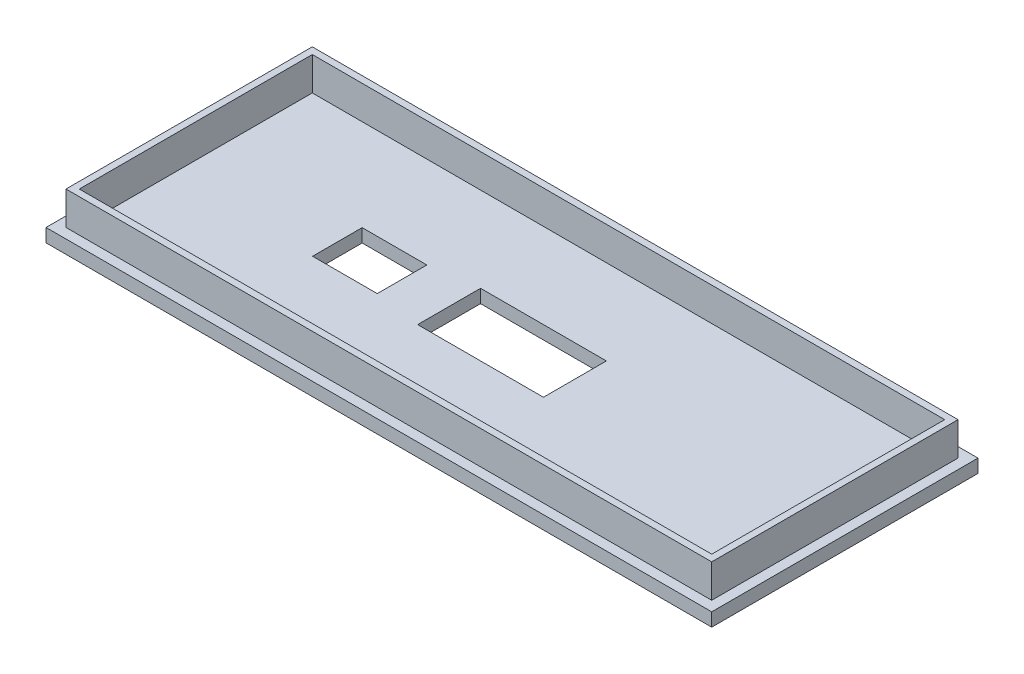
ISO-10303-21;
HEADER;
FILE_DESCRIPTION(('STEP AP214'),'2;1');
FILE_NAME('part.step','',(''),(''),'','','');
FILE_SCHEMA(('AUTOMOTIVE_DESIGN { 1 0 10303 214 1 1 1 1 }'));
ENDSEC;
DATA;
#1=APPLICATION_CONTEXT('core data for automotive mechanical design processes');
#2=APPLICATION_PROTOCOL_DEFINITION('international standard','automotive_design',2000,#1);
#3=PRODUCT_CONTEXT('',#1,'mechanical');
#4=PRODUCT('Part','Part','',(#3));
#5=PRODUCT_RELATED_PRODUCT_CATEGORY('part','',(#4));
#6=PRODUCT_DEFINITION_FORMATION('','',#4);
#7=PRODUCT_DEFINITION_CONTEXT('part definition',#1,'design');
#8=PRODUCT_DEFINITION('design','',#6,#7);
#9=PRODUCT_DEFINITION_SHAPE('','',#8);
#10=(LENGTH_UNIT() NAMED_UNIT(*) SI_UNIT(.MILLI.,.METRE.));
#11=(NAMED_UNIT(*) PLANE_ANGLE_UNIT() SI_UNIT($,.RADIAN.));
#12=(NAMED_UNIT(*) SI_UNIT($,.STERADIAN.) SOLID_ANGLE_UNIT());
#13=UNCERTAINTY_MEASURE_WITH_UNIT(LENGTH_MEASURE(1.E-05),#10,'distance_accuracy_value','');
#14=(GEOMETRIC_REPRESENTATION_CONTEXT(3) GLOBAL_UNCERTAINTY_ASSIGNED_CONTEXT((#13)) GLOBAL_UNIT_ASSIGNED_CONTEXT((#10,
#11,#12)) REPRESENTATION_CONTEXT('',''));
#15=CARTESIAN_POINT('',(0.,0.,0.));
#16=DIRECTION('',(0.,0.,1.));
#17=DIRECTION('',(1.,0.,0.));
#18=AXIS2_PLACEMENT_3D('',#15,#16,#17);
#19=CARTESIAN_POINT('',(63.5,2.54,-25.4));
#20=DIRECTION('',(-1.,0.,0.));
#21=DIRECTION('',(0.,0.,1.));
#22=AXIS2_PLACEMENT_3D('',#19,#20,#21);
#23=PLANE('',#22);
#24=DIRECTION('',(0.,0.,-1.));
#25=VECTOR('',#24,1.);
#26=CARTESIAN_POINT('',(63.5,0.,-25.4));
#27=LINE('',#26,#25);
#28=CARTESIAN_POINT('',(63.5,0.,25.4));
#29=VERTEX_POINT('',#28);
#30=CARTESIAN_POINT('',(63.5,0.,-25.4));
#31=VERTEX_POINT('',#30);
#32=EDGE_CURVE('E349',#29,#31,#27,.T.);
#33=ORIENTED_EDGE('',*,*,#32,.T.);
#34=DIRECTION('',(0.,-1.,0.));
#35=VECTOR('',#34,1.);
#36=CARTESIAN_POINT('',(63.5,2.54,-25.4));
#37=LINE('',#36,#35);
#38=CARTESIAN_POINT('',(63.5,2.54,-25.4));
#39=VERTEX_POINT('',#38);
#40=EDGE_CURVE('E387',#39,#31,#37,.T.);
#41=ORIENTED_EDGE('',*,*,#40,.F.);
#42=DIRECTION('',(0.,0.,-1.));
#43=VECTOR('',#42,1.);
#44=CARTESIAN_POINT('',(63.5,2.54,-25.4));
#45=LINE('',#44,#43);
#46=CARTESIAN_POINT('',(63.5,2.54,25.4));
#47=VERTEX_POINT('',#46);
#48=EDGE_CURVE('E350',#47,#39,#45,.T.);
#49=ORIENTED_EDGE('',*,*,#48,.F.);
#50=DIRECTION('',(0.,-1.,0.));
#51=VECTOR('',#50,1.);
#52=CARTESIAN_POINT('',(63.5,2.54,25.4));
#53=LINE('',#52,#51);
#54=EDGE_CURVE('E364',#47,#29,#53,.T.);
#55=ORIENTED_EDGE('',*,*,#54,.T.);
#56=EDGE_LOOP('',(#33,#41,#49,#55));
#57=FACE_BOUND('',#56,.T.);
#58=ADVANCED_FACE('F43',(#57),#23,.F.);
#59=CARTESIAN_POINT('',(-63.5,2.54,-25.4));
#60=DIRECTION('',(0.,0.,1.));
#61=DIRECTION('',(1.,0.,0.));
#62=AXIS2_PLACEMENT_3D('',#59,#60,#61);
#63=PLANE('',#62);
#64=DIRECTION('',(-1.,0.,0.));
#65=VECTOR('',#64,1.);
#66=CARTESIAN_POINT('',(-63.5,0.,-25.4));
#67=LINE('',#66,#65);
#68=CARTESIAN_POINT('',(-63.5,0.,-25.4));
#69=VERTEX_POINT('',#68);
#70=EDGE_CURVE('E368',#31,#69,#67,.T.);
#71=ORIENTED_EDGE('',*,*,#70,.T.);
#72=DIRECTION('',(0.,-1.,0.));
#73=VECTOR('',#72,1.);
#74=CARTESIAN_POINT('',(-63.5,2.54,-25.4));
#75=LINE('',#74,#73);
#76=CARTESIAN_POINT('',(-63.5,2.54,-25.4));
#77=VERTEX_POINT('',#76);
#78=EDGE_CURVE('E383',#77,#69,#75,.T.);
#79=ORIENTED_EDGE('',*,*,#78,.F.);
#80=DIRECTION('',(-1.,0.,0.));
#81=VECTOR('',#80,1.);
#82=CARTESIAN_POINT('',(-63.5,2.54,-25.4));
#83=LINE('',#82,#81);
#84=EDGE_CURVE('E354',#39,#77,#83,.T.);
#85=ORIENTED_EDGE('',*,*,#84,.F.);
#86=ORIENTED_EDGE('',*,*,#40,.T.);
#87=EDGE_LOOP('',(#71,#79,#85,#86));
#88=FACE_BOUND('',#87,.T.);
#89=ADVANCED_FACE('F415',(#88),#63,.F.);
#90=CARTESIAN_POINT('',(-63.5,2.54,-25.4));
#91=DIRECTION('',(1.,0.,0.));
#92=DIRECTION('',(0.,0.,-1.));
#93=AXIS2_PLACEMENT_3D('',#90,#91,#92);
#94=PLANE('',#93);
#95=DIRECTION('',(0.,0.,1.));
#96=VECTOR('',#95,1.);
#97=CARTESIAN_POINT('',(-63.5,0.,-25.4));
#98=LINE('',#97,#96);
#99=CARTESIAN_POINT('',(-63.5,0.,25.4));
#100=VERTEX_POINT('',#99);
#101=EDGE_CURVE('E371',#69,#100,#98,.T.);
#102=ORIENTED_EDGE('',*,*,#101,.T.);
#103=DIRECTION('',(0.,-1.,0.));
#104=VECTOR('',#103,1.);
#105=CARTESIAN_POINT('',(-63.5,2.54,25.4));
#106=LINE('',#105,#104);
#107=CARTESIAN_POINT('',(-63.5,2.54,25.4));
#108=VERTEX_POINT('',#107);
#109=EDGE_CURVE('E379',#108,#100,#106,.T.);
#110=ORIENTED_EDGE('',*,*,#109,.F.);
#111=DIRECTION('',(0.,0.,1.));
#112=VECTOR('',#111,1.);
#113=CARTESIAN_POINT('',(-63.5,2.54,-25.4));
#114=LINE('',#113,#112);
#115=EDGE_CURVE('E358',#77,#108,#114,.T.);
#116=ORIENTED_EDGE('',*,*,#115,.F.);
#117=ORIENTED_EDGE('',*,*,#78,.T.);
#118=EDGE_LOOP('',(#102,#110,#116,#117));
#119=FACE_BOUND('',#118,.T.);
#120=ADVANCED_FACE('F420',(#119),#94,.F.);
#121=CARTESIAN_POINT('',(-63.5,2.54,25.4));
#122=DIRECTION('',(0.,0.,-1.));
#123=DIRECTION('',(-1.,0.,0.));
#124=AXIS2_PLACEMENT_3D('',#121,#122,#123);
#125=PLANE('',#124);
#126=DIRECTION('',(1.,0.,0.));
#127=VECTOR('',#126,1.);
#128=CARTESIAN_POINT('',(-63.5,0.,25.4));
#129=LINE('',#128,#127);
#130=EDGE_CURVE('E355',#100,#29,#129,.T.);
#131=ORIENTED_EDGE('',*,*,#130,.T.);
#132=ORIENTED_EDGE('',*,*,#54,.F.);
#133=DIRECTION('',(1.,0.,0.));
#134=VECTOR('',#133,1.);
#135=CARTESIAN_POINT('',(-63.5,2.54,25.4));
#136=LINE('',#135,#134);
#137=EDGE_CURVE('E361',#108,#47,#136,.T.);
#138=ORIENTED_EDGE('',*,*,#137,.F.);
#139=ORIENTED_EDGE('',*,*,#109,.T.);
#140=EDGE_LOOP('',(#131,#132,#138,#139));
#141=FACE_BOUND('',#140,.T.);
#142=ADVANCED_FACE('F436',(#141),#125,.F.);
#143=CARTESIAN_POINT('',(0.,2.54,0.));
#144=DIRECTION('',(0.,1.,0.));
#145=DIRECTION('',(0.,0.,1.));
#146=AXIS2_PLACEMENT_3D('',#143,#144,#145);
#147=PLANE('',#146);
#148=DIRECTION('',(0.,0.,-1.));
#149=VECTOR('',#148,1.);
#150=CARTESIAN_POINT('',(61.595,2.54,-23.495));
#151=LINE('',#150,#149);
#152=CARTESIAN_POINT('',(61.595,2.54,23.495));
#153=VERTEX_POINT('',#152);
#154=CARTESIAN_POINT('',(61.595,2.54,-23.495));
#155=VERTEX_POINT('',#154);
#156=EDGE_CURVE('E295',#153,#155,#151,.T.);
#157=ORIENTED_EDGE('',*,*,#156,.F.);
#158=DIRECTION('',(1.,0.,0.));
#159=VECTOR('',#158,1.);
#160=CARTESIAN_POINT('',(-61.595,2.54,23.495));
#161=LINE('',#160,#159);
#162=CARTESIAN_POINT('',(-61.595,2.54,23.495));
#163=VERTEX_POINT('',#162);
#164=EDGE_CURVE('E310',#163,#153,#161,.T.);
#165=ORIENTED_EDGE('',*,*,#164,.F.);
#166=DIRECTION('',(0.,0.,1.));
#167=VECTOR('',#166,1.);
#168=CARTESIAN_POINT('',(-61.595,2.54,-23.495));
#169=LINE('',#168,#167);
#170=CARTESIAN_POINT('',(-61.595,2.54,-23.495));
#171=VERTEX_POINT('',#170);
#172=EDGE_CURVE('E327',#171,#163,#169,.T.);
#173=ORIENTED_EDGE('',*,*,#172,.F.);
#174=DIRECTION('',(-1.,0.,0.));
#175=VECTOR('',#174,1.);
#176=CARTESIAN_POINT('',(-61.595,2.54,-23.495));
#177=LINE('',#176,#175);
#178=EDGE_CURVE('E323',#155,#171,#177,.T.);
#179=ORIENTED_EDGE('',*,*,#178,.F.);
#180=EDGE_LOOP('',(#157,#165,#173,#179));
#181=FACE_BOUND('',#180,.T.);
#182=ORIENTED_EDGE('',*,*,#48,.T.);
#183=ORIENTED_EDGE('',*,*,#84,.T.);
#184=ORIENTED_EDGE('',*,*,#115,.T.);
#185=ORIENTED_EDGE('',*,*,#137,.T.);
#186=EDGE_LOOP('',(#182,#183,#184,#185));
#187=FACE_BOUND('',#186,.T.);
#188=ADVANCED_FACE('F432',(#181,#187),#147,.T.);
#189=CARTESIAN_POINT('',(0.,0.,0.));
#190=DIRECTION('',(0.,1.,0.));
#191=DIRECTION('',(0.,0.,1.));
#192=AXIS2_PLACEMENT_3D('',#189,#190,#191);
#193=PLANE('',#192);
#194=DIRECTION('',(1.,0.,0.));
#195=VECTOR('',#194,1.);
#196=CARTESIAN_POINT('',(0.,0.,6.));
#197=LINE('',#196,#195);
#198=CARTESIAN_POINT('',(-12.,0.,6.));
#199=VERTEX_POINT('',#198);
#200=CARTESIAN_POINT('',(12.,0.,6.));
#201=VERTEX_POINT('',#200);
#202=EDGE_CURVE('E51',#199,#201,#197,.T.);
#203=ORIENTED_EDGE('',*,*,#202,.T.);
#204=DIRECTION('',(0.,0.,-1.));
#205=VECTOR('',#204,1.);
#206=CARTESIAN_POINT('',(12.,0.,0.));
#207=LINE('',#206,#205);
#208=CARTESIAN_POINT('',(12.,0.,-6.));
#209=VERTEX_POINT('',#208);
#210=EDGE_CURVE('E11',#201,#209,#207,.T.);
#211=ORIENTED_EDGE('',*,*,#210,.T.);
#212=DIRECTION('',(-1.,0.,0.));
#213=VECTOR('',#212,1.);
#214=CARTESIAN_POINT('',(0.,0.,-6.));
#215=LINE('',#214,#213);
#216=CARTESIAN_POINT('',(-12.,0.,-6.));
#217=VERTEX_POINT('',#216);
#218=EDGE_CURVE('E185',#209,#217,#215,.T.);
#219=ORIENTED_EDGE('',*,*,#218,.T.);
#220=DIRECTION('',(0.,0.,1.));
#221=VECTOR('',#220,1.);
#222=CARTESIAN_POINT('',(-12.,0.,0.));
#223=LINE('',#222,#221);
#224=EDGE_CURVE('E393',#217,#199,#223,.T.);
#225=ORIENTED_EDGE('',*,*,#224,.T.);
#226=EDGE_LOOP('',(#203,#211,#219,#225));
#227=FACE_BOUND('',#226,.T.);
#228=DIRECTION('',(1.,0.,0.));
#229=VECTOR('',#228,1.);
#230=CARTESIAN_POINT('',(0.,0.,4.72998982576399));
#231=LINE('',#230,#229);
#232=CARTESIAN_POINT('',(-33.3155805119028,0.,4.72998982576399));
#233=VERTEX_POINT('',#232);
#234=CARTESIAN_POINT('',(-20.9764766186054,0.,4.72998982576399));
#235=VERTEX_POINT('',#234);
#236=EDGE_CURVE('E252',#233,#235,#231,.T.);
#237=ORIENTED_EDGE('',*,*,#236,.T.);
#238=DIRECTION('',(0.,0.,-1.));
#239=VECTOR('',#238,1.);
#240=CARTESIAN_POINT('',(-20.9764766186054,0.,0.));
#241=LINE('',#240,#239);
#242=CARTESIAN_POINT('',(-20.9764766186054,0.,-4.72998982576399));
#243=VERTEX_POINT('',#242);
#244=EDGE_CURVE('E256',#235,#243,#241,.T.);
#245=ORIENTED_EDGE('',*,*,#244,.T.);
#246=DIRECTION('',(-1.,0.,0.));
#247=VECTOR('',#246,1.);
#248=CARTESIAN_POINT('',(0.,0.,-4.72998982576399));
#249=LINE('',#248,#247);
#250=CARTESIAN_POINT('',(-33.3155805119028,0.,-4.72998982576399));
#251=VERTEX_POINT('',#250);
#252=EDGE_CURVE('E213',#243,#251,#249,.T.);
#253=ORIENTED_EDGE('',*,*,#252,.T.);
#254=DIRECTION('',(0.,0.,1.));
#255=VECTOR('',#254,1.);
#256=CARTESIAN_POINT('',(-33.3155805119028,0.,0.));
#257=LINE('',#256,#255);
#258=EDGE_CURVE('E248',#251,#233,#257,.T.);
#259=ORIENTED_EDGE('',*,*,#258,.T.);
#260=EDGE_LOOP('',(#237,#245,#253,#259));
#261=FACE_BOUND('',#260,.T.);
#262=ORIENTED_EDGE('',*,*,#32,.F.);
#263=ORIENTED_EDGE('',*,*,#130,.F.);
#264=ORIENTED_EDGE('',*,*,#101,.F.);
#265=ORIENTED_EDGE('',*,*,#70,.F.);
#266=EDGE_LOOP('',(#262,#263,#264,#265));
#267=FACE_BOUND('',#266,.T.);
#268=ADVANCED_FACE('F399',(#227,#261,#267),#193,.F.);
#269=CARTESIAN_POINT('',(61.595,8.89,-23.495));
#270=DIRECTION('',(-1.,0.,0.));
#271=DIRECTION('',(0.,0.,1.));
#272=AXIS2_PLACEMENT_3D('',#269,#270,#271);
#273=PLANE('',#272);
#274=ORIENTED_EDGE('',*,*,#156,.T.);
#275=DIRECTION('',(0.,-1.,0.));
#276=VECTOR('',#275,1.);
#277=CARTESIAN_POINT('',(61.595,8.89,-23.495));
#278=LINE('',#277,#276);
#279=CARTESIAN_POINT('',(61.595,8.89,-23.495));
#280=VERTEX_POINT('',#279);
#281=EDGE_CURVE('E345',#280,#155,#278,.T.);
#282=ORIENTED_EDGE('',*,*,#281,.F.);
#283=DIRECTION('',(0.,0.,-1.));
#284=VECTOR('',#283,1.);
#285=CARTESIAN_POINT('',(61.595,8.89,-23.495));
#286=LINE('',#285,#284);
#287=CARTESIAN_POINT('',(61.595,8.89,23.495));
#288=VERTEX_POINT('',#287);
#289=EDGE_CURVE('E305',#288,#280,#286,.T.);
#290=ORIENTED_EDGE('',*,*,#289,.F.);
#291=DIRECTION('',(0.,-1.,0.));
#292=VECTOR('',#291,1.);
#293=CARTESIAN_POINT('',(61.595,8.89,23.495));
#294=LINE('',#293,#292);
#295=EDGE_CURVE('E319',#288,#153,#294,.T.);
#296=ORIENTED_EDGE('',*,*,#295,.T.);
#297=EDGE_LOOP('',(#274,#282,#290,#296));
#298=FACE_BOUND('',#297,.T.);
#299=ADVANCED_FACE('F447',(#298),#273,.F.);
#300=CARTESIAN_POINT('',(-61.595,8.89,-23.495));
#301=DIRECTION('',(0.,0.,1.));
#302=DIRECTION('',(1.,0.,0.));
#303=AXIS2_PLACEMENT_3D('',#300,#301,#302);
#304=PLANE('',#303);
#305=ORIENTED_EDGE('',*,*,#178,.T.);
#306=DIRECTION('',(0.,-1.,0.));
#307=VECTOR('',#306,1.);
#308=CARTESIAN_POINT('',(-61.595,8.89,-23.495));
#309=LINE('',#308,#307);
#310=CARTESIAN_POINT('',(-61.595,8.89,-23.495));
#311=VERTEX_POINT('',#310);
#312=EDGE_CURVE('E341',#311,#171,#309,.T.);
#313=ORIENTED_EDGE('',*,*,#312,.F.);
#314=DIRECTION('',(-1.,0.,0.));
#315=VECTOR('',#314,1.);
#316=CARTESIAN_POINT('',(-61.595,8.89,-23.495));
#317=LINE('',#316,#315);
#318=EDGE_CURVE('E309',#280,#311,#317,.T.);
#319=ORIENTED_EDGE('',*,*,#318,.F.);
#320=ORIENTED_EDGE('',*,*,#281,.T.);
#321=EDGE_LOOP('',(#305,#313,#319,#320));
#322=FACE_BOUND('',#321,.T.);
#323=ADVANCED_FACE('F453',(#322),#304,.F.);
#324=CARTESIAN_POINT('',(-61.595,8.89,-23.495));
#325=DIRECTION('',(1.,0.,0.));
#326=DIRECTION('',(0.,0.,-1.));
#327=AXIS2_PLACEMENT_3D('',#324,#325,#326);
#328=PLANE('',#327);
#329=ORIENTED_EDGE('',*,*,#172,.T.);
#330=DIRECTION('',(0.,-1.,0.));
#331=VECTOR('',#330,1.);
#332=CARTESIAN_POINT('',(-61.595,8.89,23.495));
#333=LINE('',#332,#331);
#334=CARTESIAN_POINT('',(-61.595,8.89,23.495));
#335=VERTEX_POINT('',#334);
#336=EDGE_CURVE('E337',#335,#163,#333,.T.);
#337=ORIENTED_EDGE('',*,*,#336,.F.);
#338=DIRECTION('',(0.,0.,1.));
#339=VECTOR('',#338,1.);
#340=CARTESIAN_POINT('',(-61.595,8.89,-23.495));
#341=LINE('',#340,#339);
#342=EDGE_CURVE('E313',#311,#335,#341,.T.);
#343=ORIENTED_EDGE('',*,*,#342,.F.);
#344=ORIENTED_EDGE('',*,*,#312,.T.);
#345=EDGE_LOOP('',(#329,#337,#343,#344));
#346=FACE_BOUND('',#345,.T.);
#347=ADVANCED_FACE('F457',(#346),#328,.F.);
#348=CARTESIAN_POINT('',(-61.595,8.89,23.495));
#349=DIRECTION('',(0.,0.,-1.));
#350=DIRECTION('',(-1.,0.,0.));
#351=AXIS2_PLACEMENT_3D('',#348,#349,#350);
#352=PLANE('',#351);
#353=ORIENTED_EDGE('',*,*,#164,.T.);
#354=ORIENTED_EDGE('',*,*,#295,.F.);
#355=DIRECTION('',(1.,0.,0.));
#356=VECTOR('',#355,1.);
#357=CARTESIAN_POINT('',(-61.595,8.89,23.495));
#358=LINE('',#357,#356);
#359=EDGE_CURVE('E316',#335,#288,#358,.T.);
#360=ORIENTED_EDGE('',*,*,#359,.F.);
#361=ORIENTED_EDGE('',*,*,#336,.T.);
#362=EDGE_LOOP('',(#353,#354,#360,#361));
#363=FACE_BOUND('',#362,.T.);
#364=ADVANCED_FACE('F461',(#363),#352,.F.);
#365=CARTESIAN_POINT('',(0.,8.89,0.));
#366=DIRECTION('',(0.,1.,0.));
#367=DIRECTION('',(0.,0.,1.));
#368=AXIS2_PLACEMENT_3D('',#365,#366,#367);
#369=PLANE('',#368);
#370=DIRECTION('',(0.,0.,-1.));
#371=VECTOR('',#370,1.);
#372=CARTESIAN_POINT('',(60.325,8.89,-22.225));
#373=LINE('',#372,#371);
#374=CARTESIAN_POINT('',(60.325,8.89,22.225));
#375=VERTEX_POINT('',#374);
#376=CARTESIAN_POINT('',(60.325,8.89,-22.225));
#377=VERTEX_POINT('',#376);
#378=EDGE_CURVE('E260',#375,#377,#373,.T.);
#379=ORIENTED_EDGE('',*,*,#378,.F.);
#380=DIRECTION('',(1.,0.,0.));
#381=VECTOR('',#380,1.);
#382=CARTESIAN_POINT('',(-60.325,8.89,22.225));
#383=LINE('',#382,#381);
#384=CARTESIAN_POINT('',(-60.325,8.89,22.225));
#385=VERTEX_POINT('',#384);
#386=EDGE_CURVE('E266',#385,#375,#383,.T.);
#387=ORIENTED_EDGE('',*,*,#386,.F.);
#388=DIRECTION('',(0.,0.,1.));
#389=VECTOR('',#388,1.);
#390=CARTESIAN_POINT('',(-60.325,8.89,-22.225));
#391=LINE('',#390,#389);
#392=CARTESIAN_POINT('',(-60.325,8.89,-22.225));
#393=VERTEX_POINT('',#392);
#394=EDGE_CURVE('E285',#393,#385,#391,.T.);
#395=ORIENTED_EDGE('',*,*,#394,.F.);
#396=DIRECTION('',(-1.,0.,0.));
#397=VECTOR('',#396,1.);
#398=CARTESIAN_POINT('',(-60.325,8.89,-22.225));
#399=LINE('',#398,#397);
#400=EDGE_CURVE('E281',#377,#393,#399,.T.);
#401=ORIENTED_EDGE('',*,*,#400,.F.);
#402=EDGE_LOOP('',(#379,#387,#395,#401));
#403=FACE_BOUND('',#402,.T.);
#404=ORIENTED_EDGE('',*,*,#289,.T.);
#405=ORIENTED_EDGE('',*,*,#318,.T.);
#406=ORIENTED_EDGE('',*,*,#342,.T.);
#407=ORIENTED_EDGE('',*,*,#359,.T.);
#408=EDGE_LOOP('',(#404,#405,#406,#407));
#409=FACE_BOUND('',#408,.T.);
#410=ADVANCED_FACE('F465',(#403,#409),#369,.T.);
#411=CARTESIAN_POINT('',(60.325,2.54,-22.225));
#412=DIRECTION('',(1.,0.,0.));
#413=DIRECTION('',(0.,0.,-1.));
#414=AXIS2_PLACEMENT_3D('',#411,#412,#413);
#415=PLANE('',#414);
#416=ORIENTED_EDGE('',*,*,#378,.T.);
#417=DIRECTION('',(0.,1.,0.));
#418=VECTOR('',#417,1.);
#419=CARTESIAN_POINT('',(60.325,2.54,-22.225));
#420=LINE('',#419,#418);
#421=CARTESIAN_POINT('',(60.325,2.54,-22.225));
#422=VERTEX_POINT('',#421);
#423=EDGE_CURVE('E278',#422,#377,#420,.T.);
#424=ORIENTED_EDGE('',*,*,#423,.F.);
#425=DIRECTION('',(0.,0.,-1.));
#426=VECTOR('',#425,1.);
#427=CARTESIAN_POINT('',(60.325,2.54,-22.225));
#428=LINE('',#427,#426);
#429=CARTESIAN_POINT('',(60.325,2.54,22.225));
#430=VERTEX_POINT('',#429);
#431=EDGE_CURVE('E261',#430,#422,#428,.T.);
#432=ORIENTED_EDGE('',*,*,#431,.F.);
#433=DIRECTION('',(0.,1.,0.));
#434=VECTOR('',#433,1.);
#435=CARTESIAN_POINT('',(60.325,2.54,22.225));
#436=LINE('',#435,#434);
#437=EDGE_CURVE('E292',#430,#375,#436,.T.);
#438=ORIENTED_EDGE('',*,*,#437,.T.);
#439=EDGE_LOOP('',(#416,#424,#432,#438));
#440=FACE_BOUND('',#439,.T.);
#441=ADVANCED_FACE('F469',(#440),#415,.F.);
#442=CARTESIAN_POINT('',(-60.325,2.54,22.225));
#443=DIRECTION('',(0.,0.,1.));
#444=DIRECTION('',(1.,0.,0.));
#445=AXIS2_PLACEMENT_3D('',#442,#443,#444);
#446=PLANE('',#445);
#447=ORIENTED_EDGE('',*,*,#386,.T.);
#448=ORIENTED_EDGE('',*,*,#437,.F.);
#449=DIRECTION('',(1.,0.,0.));
#450=VECTOR('',#449,1.);
#451=CARTESIAN_POINT('',(-60.325,2.54,22.225));
#452=LINE('',#451,#450);
#453=CARTESIAN_POINT('',(-60.325,2.54,22.225));
#454=VERTEX_POINT('',#453);
#455=EDGE_CURVE('E274',#454,#430,#452,.T.);
#456=ORIENTED_EDGE('',*,*,#455,.F.);
#457=DIRECTION('',(0.,1.,0.));
#458=VECTOR('',#457,1.);
#459=CARTESIAN_POINT('',(-60.325,2.54,22.225));
#460=LINE('',#459,#458);
#461=EDGE_CURVE('E296',#454,#385,#460,.T.);
#462=ORIENTED_EDGE('',*,*,#461,.T.);
#463=EDGE_LOOP('',(#447,#448,#456,#462));
#464=FACE_BOUND('',#463,.T.);
#465=ADVANCED_FACE('F473',(#464),#446,.F.);
#466=CARTESIAN_POINT('',(-60.325,2.54,-22.225));
#467=DIRECTION('',(-1.,0.,0.));
#468=DIRECTION('',(0.,0.,1.));
#469=AXIS2_PLACEMENT_3D('',#466,#467,#468);
#470=PLANE('',#469);
#471=ORIENTED_EDGE('',*,*,#394,.T.);
#472=ORIENTED_EDGE('',*,*,#461,.F.);
#473=DIRECTION('',(0.,0.,1.));
#474=VECTOR('',#473,1.);
#475=CARTESIAN_POINT('',(-60.325,2.54,-22.225));
#476=LINE('',#475,#474);
#477=CARTESIAN_POINT('',(-60.325,2.54,-22.225));
#478=VERTEX_POINT('',#477);
#479=EDGE_CURVE('E270',#478,#454,#476,.T.);
#480=ORIENTED_EDGE('',*,*,#479,.F.);
#481=DIRECTION('',(0.,1.,0.));
#482=VECTOR('',#481,1.);
#483=CARTESIAN_POINT('',(-60.325,2.54,-22.225));
#484=LINE('',#483,#482);
#485=EDGE_CURVE('E299',#478,#393,#484,.T.);
#486=ORIENTED_EDGE('',*,*,#485,.T.);
#487=EDGE_LOOP('',(#471,#472,#480,#486));
#488=FACE_BOUND('',#487,.T.);
#489=ADVANCED_FACE('F478',(#488),#470,.F.);
#490=CARTESIAN_POINT('',(-60.325,2.54,-22.225));
#491=DIRECTION('',(0.,0.,-1.));
#492=DIRECTION('',(-1.,0.,0.));
#493=AXIS2_PLACEMENT_3D('',#490,#491,#492);
#494=PLANE('',#493);
#495=ORIENTED_EDGE('',*,*,#400,.T.);
#496=ORIENTED_EDGE('',*,*,#485,.F.);
#497=DIRECTION('',(-1.,0.,0.));
#498=VECTOR('',#497,1.);
#499=CARTESIAN_POINT('',(-60.325,2.54,-22.225));
#500=LINE('',#499,#498);
#501=EDGE_CURVE('E265',#422,#478,#500,.T.);
#502=ORIENTED_EDGE('',*,*,#501,.F.);
#503=ORIENTED_EDGE('',*,*,#423,.T.);
#504=EDGE_LOOP('',(#495,#496,#502,#503));
#505=FACE_BOUND('',#504,.T.);
#506=ADVANCED_FACE('F475',(#505),#494,.F.);
#507=CARTESIAN_POINT('',(0.,2.54,0.));
#508=DIRECTION('',(0.,1.,0.));
#509=DIRECTION('',(0.,0.,1.));
#510=AXIS2_PLACEMENT_3D('',#507,#508,#509);
#511=PLANE('',#510);
#512=DIRECTION('',(0.,0.,-1.));
#513=VECTOR('',#512,1.);
#514=CARTESIAN_POINT('',(12.,2.54,-6.));
#515=LINE('',#514,#513);
#516=CARTESIAN_POINT('',(12.,2.54,6.));
#517=VERTEX_POINT('',#516);
#518=CARTESIAN_POINT('',(12.,2.54,-6.));
#519=VERTEX_POINT('',#518);
#520=EDGE_CURVE('E191',#517,#519,#515,.T.);
#521=ORIENTED_EDGE('',*,*,#520,.F.);
#522=DIRECTION('',(1.,0.,0.));
#523=VECTOR('',#522,1.);
#524=CARTESIAN_POINT('',(-12.,2.54,6.));
#525=LINE('',#524,#523);
#526=CARTESIAN_POINT('',(-12.,2.54,6.));
#527=VERTEX_POINT('',#526);
#528=EDGE_CURVE('E188',#527,#517,#525,.T.);
#529=ORIENTED_EDGE('',*,*,#528,.F.);
#530=DIRECTION('',(0.,0.,1.));
#531=VECTOR('',#530,1.);
#532=CARTESIAN_POINT('',(-12.,2.54,-6.));
#533=LINE('',#532,#531);
#534=CARTESIAN_POINT('',(-12.,2.54,-6.));
#535=VERTEX_POINT('',#534);
#536=EDGE_CURVE('E203',#535,#527,#533,.T.);
#537=ORIENTED_EDGE('',*,*,#536,.F.);
#538=DIRECTION('',(-1.,0.,0.));
#539=VECTOR('',#538,1.);
#540=CARTESIAN_POINT('',(-12.,2.54,-6.));
#541=LINE('',#540,#539);
#542=EDGE_CURVE('E182',#519,#535,#541,.T.);
#543=ORIENTED_EDGE('',*,*,#542,.F.);
#544=EDGE_LOOP('',(#521,#529,#537,#543));
#545=FACE_BOUND('',#544,.T.);
#546=DIRECTION('',(0.,0.,-1.));
#547=VECTOR('',#546,1.);
#548=CARTESIAN_POINT('',(-20.9764766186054,2.54,-4.72998982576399));
#549=LINE('',#548,#547);
#550=CARTESIAN_POINT('',(-20.9764766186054,2.54,4.72998982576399));
#551=VERTEX_POINT('',#550);
#552=CARTESIAN_POINT('',(-20.9764766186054,2.54,-4.72998982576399));
#553=VERTEX_POINT('',#552);
#554=EDGE_CURVE('E199',#551,#553,#549,.T.);
#555=ORIENTED_EDGE('',*,*,#554,.F.);
#556=DIRECTION('',(1.,0.,0.));
#557=VECTOR('',#556,1.);
#558=CARTESIAN_POINT('',(-33.3155805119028,2.54,4.72998982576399));
#559=LINE('',#558,#557);
#560=CARTESIAN_POINT('',(-33.3155805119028,2.54,4.72998982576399));
#561=VERTEX_POINT('',#560);
#562=EDGE_CURVE('E224',#561,#551,#559,.T.);
#563=ORIENTED_EDGE('',*,*,#562,.F.);
#564=DIRECTION('',(0.,0.,1.));
#565=VECTOR('',#564,1.);
#566=CARTESIAN_POINT('',(-33.3155805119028,2.54,-4.72998982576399));
#567=LINE('',#566,#565);
#568=CARTESIAN_POINT('',(-33.3155805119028,2.54,-4.72998982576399));
#569=VERTEX_POINT('',#568);
#570=EDGE_CURVE('E236',#569,#561,#567,.T.);
#571=ORIENTED_EDGE('',*,*,#570,.F.);
#572=DIRECTION('',(-1.,0.,0.));
#573=VECTOR('',#572,1.);
#574=CARTESIAN_POINT('',(-33.3155805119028,2.54,-4.72998982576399));
#575=LINE('',#574,#573);
#576=EDGE_CURVE('E240',#553,#569,#575,.T.);
#577=ORIENTED_EDGE('',*,*,#576,.F.);
#578=EDGE_LOOP('',(#555,#563,#571,#577));
#579=FACE_BOUND('',#578,.T.);
#580=ORIENTED_EDGE('',*,*,#431,.T.);
#581=ORIENTED_EDGE('',*,*,#501,.T.);
#582=ORIENTED_EDGE('',*,*,#479,.T.);
#583=ORIENTED_EDGE('',*,*,#455,.T.);
#584=EDGE_LOOP('',(#580,#581,#582,#583));
#585=FACE_BOUND('',#584,.T.);
#586=ADVANCED_FACE('F201',(#545,#579,#585),#511,.T.);
#587=CARTESIAN_POINT('',(-20.9764766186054,-7.46,-4.72998982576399));
#588=DIRECTION('',(1.,0.,0.));
#589=DIRECTION('',(0.,0.,-1.));
#590=AXIS2_PLACEMENT_3D('',#587,#588,#589);
#591=PLANE('',#590);
#592=DIRECTION('',(0.,1.,0.));
#593=VECTOR('',#592,1.);
#594=CARTESIAN_POINT('',(-20.9764766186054,-7.46,4.72998982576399));
#595=LINE('',#594,#593);
#596=EDGE_CURVE('E230',#235,#551,#595,.T.);
#597=ORIENTED_EDGE('',*,*,#596,.T.);
#598=ORIENTED_EDGE('',*,*,#554,.T.);
#599=DIRECTION('',(0.,1.,0.));
#600=VECTOR('',#599,1.);
#601=CARTESIAN_POINT('',(-20.9764766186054,-7.46,-4.72998982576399));
#602=LINE('',#601,#600);
#603=EDGE_CURVE('E220',#243,#553,#602,.T.);
#604=ORIENTED_EDGE('',*,*,#603,.F.);
#605=ORIENTED_EDGE('',*,*,#244,.F.);
#606=EDGE_LOOP('',(#597,#598,#604,#605));
#607=FACE_BOUND('',#606,.T.);
#608=ADVANCED_FACE('F488',(#607),#591,.F.);
#609=CARTESIAN_POINT('',(-33.3155805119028,-7.46,4.72998982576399));
#610=DIRECTION('',(0.,0.,1.));
#611=DIRECTION('',(1.,0.,0.));
#612=AXIS2_PLACEMENT_3D('',#609,#610,#611);
#613=PLANE('',#612);
#614=DIRECTION('',(0.,1.,0.));
#615=VECTOR('',#614,1.);
#616=CARTESIAN_POINT('',(-33.3155805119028,-7.46,4.72998982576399));
#617=LINE('',#616,#615);
#618=EDGE_CURVE('E227',#233,#561,#617,.T.);
#619=ORIENTED_EDGE('',*,*,#618,.T.);
#620=ORIENTED_EDGE('',*,*,#562,.T.);
#621=ORIENTED_EDGE('',*,*,#596,.F.);
#622=ORIENTED_EDGE('',*,*,#236,.F.);
#623=EDGE_LOOP('',(#619,#620,#621,#622));
#624=FACE_BOUND('',#623,.T.);
#625=ADVANCED_FACE('F489',(#624),#613,.F.);
#626=CARTESIAN_POINT('',(-33.3155805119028,-7.46,-4.72998982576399));
#627=DIRECTION('',(-1.,0.,0.));
#628=DIRECTION('',(0.,0.,1.));
#629=AXIS2_PLACEMENT_3D('',#626,#627,#628);
#630=PLANE('',#629);
#631=DIRECTION('',(0.,1.,0.));
#632=VECTOR('',#631,1.);
#633=CARTESIAN_POINT('',(-33.3155805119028,-7.46,-4.72998982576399));
#634=LINE('',#633,#632);
#635=EDGE_CURVE('E66',#251,#569,#634,.T.);
#636=ORIENTED_EDGE('',*,*,#635,.T.);
#637=ORIENTED_EDGE('',*,*,#570,.T.);
#638=ORIENTED_EDGE('',*,*,#618,.F.);
#639=ORIENTED_EDGE('',*,*,#258,.F.);
#640=EDGE_LOOP('',(#636,#637,#638,#639));
#641=FACE_BOUND('',#640,.T.);
#642=ADVANCED_FACE('F492',(#641),#630,.F.);
#643=CARTESIAN_POINT('',(-33.3155805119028,-7.46,-4.72998982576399));
#644=DIRECTION('',(0.,0.,-1.));
#645=DIRECTION('',(-1.,0.,0.));
#646=AXIS2_PLACEMENT_3D('',#643,#644,#645);
#647=PLANE('',#646);
#648=ORIENTED_EDGE('',*,*,#603,.T.);
#649=ORIENTED_EDGE('',*,*,#576,.T.);
#650=ORIENTED_EDGE('',*,*,#635,.F.);
#651=ORIENTED_EDGE('',*,*,#252,.F.);
#652=EDGE_LOOP('',(#648,#649,#650,#651));
#653=FACE_BOUND('',#652,.T.);
#654=ADVANCED_FACE('F496',(#653),#647,.F.);
#655=CARTESIAN_POINT('',(12.,-7.46,-6.));
#656=DIRECTION('',(1.,0.,0.));
#657=DIRECTION('',(0.,0.,-1.));
#658=AXIS2_PLACEMENT_3D('',#655,#656,#657);
#659=PLANE('',#658);
#660=DIRECTION('',(0.,1.,0.));
#661=VECTOR('',#660,1.);
#662=CARTESIAN_POINT('',(12.,-7.46,6.));
#663=LINE('',#662,#661);
#664=EDGE_CURVE('E194',#201,#517,#663,.T.);
#665=ORIENTED_EDGE('',*,*,#664,.T.);
#666=ORIENTED_EDGE('',*,*,#520,.T.);
#667=DIRECTION('',(0.,1.,0.));
#668=VECTOR('',#667,1.);
#669=CARTESIAN_POINT('',(12.,-7.46,-6.));
#670=LINE('',#669,#668);
#671=EDGE_CURVE('E178',#209,#519,#670,.T.);
#672=ORIENTED_EDGE('',*,*,#671,.F.);
#673=ORIENTED_EDGE('',*,*,#210,.F.);
#674=EDGE_LOOP('',(#665,#666,#672,#673));
#675=FACE_BOUND('',#674,.T.);
#676=ADVANCED_FACE('F192',(#675),#659,.F.);
#677=CARTESIAN_POINT('',(-12.,-7.46,6.));
#678=DIRECTION('',(0.,0.,1.));
#679=DIRECTION('',(1.,0.,0.));
#680=AXIS2_PLACEMENT_3D('',#677,#678,#679);
#681=PLANE('',#680);
#682=DIRECTION('',(0.,1.,0.));
#683=VECTOR('',#682,1.);
#684=CARTESIAN_POINT('',(-12.,-7.46,6.));
#685=LINE('',#684,#683);
#686=EDGE_CURVE('E214',#199,#527,#685,.T.);
#687=ORIENTED_EDGE('',*,*,#686,.T.);
#688=ORIENTED_EDGE('',*,*,#528,.T.);
#689=ORIENTED_EDGE('',*,*,#664,.F.);
#690=ORIENTED_EDGE('',*,*,#202,.F.);
#691=EDGE_LOOP('',(#687,#688,#689,#690));
#692=FACE_BOUND('',#691,.T.);
#693=ADVANCED_FACE('F403',(#692),#681,.F.);
#694=CARTESIAN_POINT('',(-12.,-7.46,-6.));
#695=DIRECTION('',(-1.,0.,0.));
#696=DIRECTION('',(0.,0.,1.));
#697=AXIS2_PLACEMENT_3D('',#694,#695,#696);
#698=PLANE('',#697);
#699=DIRECTION('',(0.,1.,0.));
#700=VECTOR('',#699,1.);
#701=CARTESIAN_POINT('',(-12.,-7.46,-6.));
#702=LINE('',#701,#700);
#703=EDGE_CURVE('E58',#217,#535,#702,.T.);
#704=ORIENTED_EDGE('',*,*,#703,.T.);
#705=ORIENTED_EDGE('',*,*,#536,.T.);
#706=ORIENTED_EDGE('',*,*,#686,.F.);
#707=ORIENTED_EDGE('',*,*,#224,.F.);
#708=EDGE_LOOP('',(#704,#705,#706,#707));
#709=FACE_BOUND('',#708,.T.);
#710=ADVANCED_FACE('F405',(#709),#698,.F.);
#711=CARTESIAN_POINT('',(-12.,-7.46,-6.));
#712=DIRECTION('',(0.,0.,-1.));
#713=DIRECTION('',(-1.,0.,0.));
#714=AXIS2_PLACEMENT_3D('',#711,#712,#713);
#715=PLANE('',#714);
#716=ORIENTED_EDGE('',*,*,#671,.T.);
#717=ORIENTED_EDGE('',*,*,#542,.T.);
#718=ORIENTED_EDGE('',*,*,#703,.F.);
#719=ORIENTED_EDGE('',*,*,#218,.F.);
#720=EDGE_LOOP('',(#716,#717,#718,#719));
#721=FACE_BOUND('',#720,.T.);
#722=ADVANCED_FACE('F180',(#721),#715,.F.);
#723=CLOSED_SHELL('',(#58,#89,#120,#142,#188,#268,#299,#323,#347,#364,#410,#441,#465,#489,#506,
#586,#608,#625,#642,#654,#676,#693,#710,#722));
#724=MANIFOLD_SOLID_BREP('B2',#723);
#725=ADVANCED_BREP_SHAPE_REPRESENTATION('',(#18,#724),#14);
#726=SHAPE_DEFINITION_REPRESENTATION(#9,#725);
ENDSEC;
END-ISO-10303-21;
